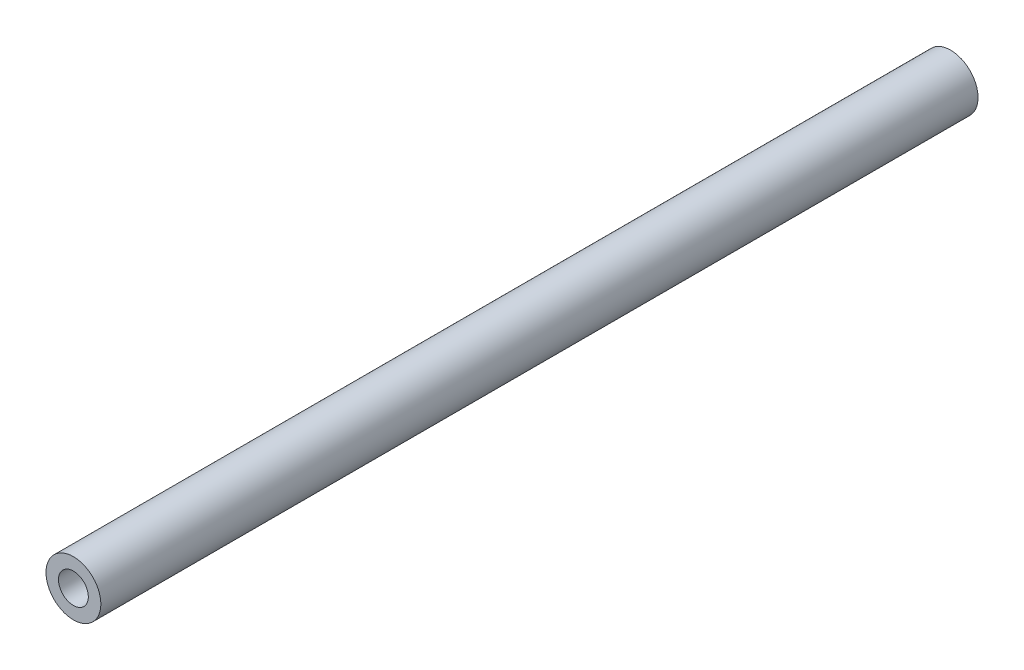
ISO-10303-21;
HEADER;
FILE_DESCRIPTION(('STEP AP214'),'2;1');
FILE_NAME('part.step','',(''),(''),'','','');
FILE_SCHEMA(('AUTOMOTIVE_DESIGN { 1 0 10303 214 1 1 1 1 }'));
ENDSEC;
DATA;
#1=APPLICATION_CONTEXT('core data for automotive mechanical design processes');
#2=APPLICATION_PROTOCOL_DEFINITION('international standard','automotive_design',2000,#1);
#3=PRODUCT_CONTEXT('',#1,'mechanical');
#4=PRODUCT('Part','Part','',(#3));
#5=PRODUCT_RELATED_PRODUCT_CATEGORY('part','',(#4));
#6=PRODUCT_DEFINITION_FORMATION('','',#4);
#7=PRODUCT_DEFINITION_CONTEXT('part definition',#1,'design');
#8=PRODUCT_DEFINITION('design','',#6,#7);
#9=PRODUCT_DEFINITION_SHAPE('','',#8);
#10=(LENGTH_UNIT() NAMED_UNIT(*) SI_UNIT(.MILLI.,.METRE.));
#11=(NAMED_UNIT(*) PLANE_ANGLE_UNIT() SI_UNIT($,.RADIAN.));
#12=(NAMED_UNIT(*) SI_UNIT($,.STERADIAN.) SOLID_ANGLE_UNIT());
#13=UNCERTAINTY_MEASURE_WITH_UNIT(LENGTH_MEASURE(1.E-05),#10,'distance_accuracy_value','');
#14=(GEOMETRIC_REPRESENTATION_CONTEXT(3) GLOBAL_UNCERTAINTY_ASSIGNED_CONTEXT((#13)) GLOBAL_UNIT_ASSIGNED_CONTEXT((#10,
#11,#12)) REPRESENTATION_CONTEXT('',''));
#15=CARTESIAN_POINT('',(0.,0.,0.));
#16=DIRECTION('',(0.,0.,1.));
#17=DIRECTION('',(1.,0.,0.));
#18=AXIS2_PLACEMENT_3D('',#15,#16,#17);
#19=CARTESIAN_POINT('',(1.11022302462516E-13,-1.94289029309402E-13,101.599999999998));
#20=DIRECTION('',(0.,0.,0.999999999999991));
#21=DIRECTION('',(1.00000000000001,0.,0.));
#22=AXIS2_PLACEMENT_3D('',#19,#20,#21);
#23=PLANE('',#22);
#24=CARTESIAN_POINT('',(1.11022302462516E-13,-1.94289029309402E-13,101.599999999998));
#25=DIRECTION('',(0.,0.,0.999999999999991));
#26=DIRECTION('',(1.00000000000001,0.,0.));
#27=AXIS2_PLACEMENT_3D('',#24,#25,#26);
#28=CIRCLE('',#27,1.72719999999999);
#29=CARTESIAN_POINT('',(1.72720000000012,-1.94193150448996E-13,101.599999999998));
#30=VERTEX_POINT('',#29);
#31=EDGE_CURVE('E63',#30,#30,#28,.T.);
#32=ORIENTED_EDGE('',*,*,#31,.F.);
#33=EDGE_LOOP('',(#32));
#34=FACE_BOUND('',#33,.T.);
#35=CARTESIAN_POINT('',(1.11022302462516E-13,-1.94289029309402E-13,101.599999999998));
#36=DIRECTION('',(0.,0.,0.999999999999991));
#37=DIRECTION('',(1.00000000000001,0.,0.));
#38=AXIS2_PLACEMENT_3D('',#35,#36,#37);
#39=CIRCLE('',#38,3.175);
#40=CARTESIAN_POINT('',(-3.17499999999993,-1.94465277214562E-13,101.599999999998));
#41=VERTEX_POINT('',#40);
#42=EDGE_CURVE('E10',#41,#41,#39,.T.);
#43=ORIENTED_EDGE('',*,*,#42,.T.);
#44=EDGE_LOOP('',(#43));
#45=FACE_BOUND('',#44,.T.);
#46=ADVANCED_FACE('F34',(#34,#45),#23,.T.);
#47=CARTESIAN_POINT('',(0.,0.,-4.44089209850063E-13));
#48=DIRECTION('',(0.,0.,0.999999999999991));
#49=DIRECTION('',(1.00000000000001,0.,0.));
#50=AXIS2_PLACEMENT_3D('',#47,#48,#49);
#51=PLANE('',#50);
#52=CARTESIAN_POINT('',(0.,0.,-4.44089209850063E-13));
#53=DIRECTION('',(0.,0.,-0.999999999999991));
#54=DIRECTION('',(-1.00000000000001,0.,0.));
#55=AXIS2_PLACEMENT_3D('',#52,#53,#54);
#56=CIRCLE('',#55,1.7272);
#57=CARTESIAN_POINT('',(-1.72719999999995,0.,-4.44089209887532E-13));
#58=VERTEX_POINT('',#57);
#59=EDGE_CURVE('E50',#58,#58,#56,.T.);
#60=ORIENTED_EDGE('',*,*,#59,.F.);
#61=EDGE_LOOP('',(#60));
#62=FACE_BOUND('',#61,.T.);
#63=CARTESIAN_POINT('',(0.,0.,-4.44089209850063E-13));
#64=DIRECTION('',(0.,0.,0.999999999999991));
#65=DIRECTION('',(1.00000000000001,0.,0.));
#66=AXIS2_PLACEMENT_3D('',#63,#64,#65);
#67=CIRCLE('',#66,3.175);
#68=CARTESIAN_POINT('',(-3.17499999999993,-1.94465277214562E-13,-4.44089209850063E-13));
#69=VERTEX_POINT('',#68);
#70=EDGE_CURVE('E42',#69,#69,#67,.T.);
#71=ORIENTED_EDGE('',*,*,#70,.F.);
#72=EDGE_LOOP('',(#71));
#73=FACE_BOUND('',#72,.T.);
#74=ADVANCED_FACE('F81',(#62,#73),#51,.F.);
#75=CARTESIAN_POINT('',(1.11022302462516E-13,-1.94289029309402E-13,101.599999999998));
#76=DIRECTION('',(0.,0.,-0.999999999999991));
#77=DIRECTION('',(-1.00000000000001,0.,0.));
#78=AXIS2_PLACEMENT_3D('',#75,#76,#77);
#79=CYLINDRICAL_SURFACE('',#78,3.175);
#80=CARTESIAN_POINT('',(-3.17499999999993,-1.94465277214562E-13,101.599999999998));
#81=CARTESIAN_POINT('',(-3.17499999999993,-1.94465277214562E-13,100.541666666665));
#82=CARTESIAN_POINT('',(-3.17499999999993,-1.94465277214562E-13,99.4833333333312));
#83=CARTESIAN_POINT('',(-3.17499999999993,-1.94465277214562E-13,97.3666666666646));
#84=CARTESIAN_POINT('',(-3.17499999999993,-1.94465277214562E-13,96.3083333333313));
#85=CARTESIAN_POINT('',(-3.17499999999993,-1.94465277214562E-13,94.1916666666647));
#86=CARTESIAN_POINT('',(-3.17499999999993,-1.94465277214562E-13,93.1333333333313));
#87=CARTESIAN_POINT('',(-3.17499999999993,-1.94465277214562E-13,91.0166666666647));
#88=CARTESIAN_POINT('',(-3.17499999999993,-1.94465277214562E-13,89.9583333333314));
#89=CARTESIAN_POINT('',(-3.17499999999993,-1.94465277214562E-13,87.8416666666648));
#90=CARTESIAN_POINT('',(-3.17499999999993,-1.94465277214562E-13,86.7833333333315));
#91=CARTESIAN_POINT('',(-3.17499999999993,-1.94465277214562E-13,84.6666666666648));
#92=CARTESIAN_POINT('',(-3.17499999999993,-1.94465277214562E-13,83.6083333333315));
#93=CARTESIAN_POINT('',(-3.17499999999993,-1.94465277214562E-13,81.4916666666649));
#94=CARTESIAN_POINT('',(-3.17499999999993,-1.94465277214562E-13,80.4333333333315));
#95=CARTESIAN_POINT('',(-3.17499999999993,-1.94465277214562E-13,78.3166666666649));
#96=CARTESIAN_POINT('',(-3.17499999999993,-1.94465277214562E-13,77.2583333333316));
#97=CARTESIAN_POINT('',(-3.17499999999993,-1.94465277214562E-13,75.141666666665));
#98=CARTESIAN_POINT('',(-3.17499999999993,-1.94465277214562E-13,74.0833333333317));
#99=CARTESIAN_POINT('',(-3.17499999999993,-1.94465277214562E-13,71.966666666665));
#100=CARTESIAN_POINT('',(-3.17499999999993,-1.94465277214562E-13,70.9083333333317));
#101=CARTESIAN_POINT('',(-3.17499999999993,-1.94465277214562E-13,68.7916666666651));
#102=CARTESIAN_POINT('',(-3.17499999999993,-1.94465277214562E-13,67.7333333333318));
#103=CARTESIAN_POINT('',(-3.17499999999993,-1.94465277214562E-13,65.6166666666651));
#104=CARTESIAN_POINT('',(-3.17499999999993,-1.94465277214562E-13,64.5583333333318));
#105=CARTESIAN_POINT('',(-3.17499999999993,-1.94465277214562E-13,62.4416666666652));
#106=CARTESIAN_POINT('',(-3.17499999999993,-1.94465277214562E-13,61.3833333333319));
#107=CARTESIAN_POINT('',(-3.17499999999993,-1.94465277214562E-13,59.2666666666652));
#108=CARTESIAN_POINT('',(-3.17499999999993,-1.94465277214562E-13,58.2083333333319));
#109=CARTESIAN_POINT('',(-3.17499999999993,-1.94465277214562E-13,56.0916666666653));
#110=CARTESIAN_POINT('',(-3.17499999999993,-1.94465277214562E-13,55.033333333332));
#111=CARTESIAN_POINT('',(-3.17499999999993,-1.94465277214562E-13,52.9166666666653));
#112=CARTESIAN_POINT('',(-3.17499999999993,-1.94465277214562E-13,51.858333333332));
#113=CARTESIAN_POINT('',(-3.17499999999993,-1.94465277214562E-13,49.7416666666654));
#114=CARTESIAN_POINT('',(-3.17499999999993,-1.94465277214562E-13,48.6833333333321));
#115=CARTESIAN_POINT('',(-3.17499999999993,-1.94465277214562E-13,46.5666666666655));
#116=CARTESIAN_POINT('',(-3.17499999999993,-1.94465277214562E-13,45.5083333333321));
#117=CARTESIAN_POINT('',(-3.17499999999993,-1.94465277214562E-13,43.3916666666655));
#118=CARTESIAN_POINT('',(-3.17499999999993,-1.94465277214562E-13,42.3333333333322));
#119=CARTESIAN_POINT('',(-3.17499999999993,-1.94465277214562E-13,40.2166666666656));
#120=CARTESIAN_POINT('',(-3.17499999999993,-1.94465277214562E-13,39.1583333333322));
#121=CARTESIAN_POINT('',(-3.17499999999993,-1.94465277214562E-13,37.0416666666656));
#122=CARTESIAN_POINT('',(-3.17499999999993,-1.94465277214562E-13,35.9833333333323));
#123=CARTESIAN_POINT('',(-3.17499999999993,-1.94465277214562E-13,33.8666666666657));
#124=CARTESIAN_POINT('',(-3.17499999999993,-1.94465277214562E-13,32.8083333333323));
#125=CARTESIAN_POINT('',(-3.17499999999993,-1.94465277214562E-13,30.6916666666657));
#126=CARTESIAN_POINT('',(-3.17499999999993,-1.94465277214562E-13,29.6333333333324));
#127=CARTESIAN_POINT('',(-3.17499999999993,-1.94465277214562E-13,27.5166666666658));
#128=CARTESIAN_POINT('',(-3.17499999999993,-1.94465277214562E-13,26.4583333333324));
#129=CARTESIAN_POINT('',(-3.17499999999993,-1.94465277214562E-13,24.3416666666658));
#130=CARTESIAN_POINT('',(-3.17499999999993,-1.94465277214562E-13,23.2833333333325));
#131=CARTESIAN_POINT('',(-3.17499999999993,-1.94465277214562E-13,21.1666666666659));
#132=CARTESIAN_POINT('',(-3.17499999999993,-1.94465277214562E-13,20.1083333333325));
#133=CARTESIAN_POINT('',(-3.17499999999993,-1.94465277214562E-13,17.9916666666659));
#134=CARTESIAN_POINT('',(-3.17499999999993,-1.94465277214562E-13,16.9333333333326));
#135=CARTESIAN_POINT('',(-3.17499999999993,-1.94465277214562E-13,14.816666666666));
#136=CARTESIAN_POINT('',(-3.17499999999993,-1.94465277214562E-13,13.7583333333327));
#137=CARTESIAN_POINT('',(-3.17499999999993,-1.94465277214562E-13,11.641666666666));
#138=CARTESIAN_POINT('',(-3.17499999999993,-1.94465277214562E-13,10.5833333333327));
#139=CARTESIAN_POINT('',(-3.17499999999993,-1.94465277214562E-13,8.46666666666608));
#140=CARTESIAN_POINT('',(-3.17499999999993,-1.94465277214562E-13,7.40833333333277));
#141=CARTESIAN_POINT('',(-3.17499999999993,-1.94465277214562E-13,5.29166666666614));
#142=CARTESIAN_POINT('',(-3.17499999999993,-1.94465277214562E-13,4.23333333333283));
#143=CARTESIAN_POINT('',(-3.17499999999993,-1.94465277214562E-13,2.11666666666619));
#144=CARTESIAN_POINT('',(-3.17499999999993,-1.94465277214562E-13,1.05833333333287));
#145=CARTESIAN_POINT('',(-3.17499999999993,-1.94465277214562E-13,-4.44089209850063E-13));
#146=B_SPLINE_CURVE_WITH_KNOTS('',3,(#80,#81,#82,#83,#84,#85,#86,#87,#88,#89,#90,#91,#92,#93,
#94,#95,#96,#97,#98,#99,#100,#101,#102,#103,#104,#105,#106,#107,#108,#109,#110,#111,#112,#113,
#114,#115,#116,#117,#118,#119,#120,#121,#122,#123,#124,#125,#126,#127,#128,#129,#130,#131,#132,
#133,#134,#135,#136,#137,#138,#139,#140,#141,#142,#143,#144,#145),.UNSPECIFIED.,.F.,.F.,(4,2,2,
2,2,2,2,2,2,2,2,2,2,2,2,2,2,2,2,2,2,2,2,2,2,2,2,2,2,2,2,2,4),(0.,3.17499999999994,
6.34999999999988,9.52499999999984,12.6999999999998,15.8749999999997,19.0499999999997,
22.2249999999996,25.3999999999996,28.5749999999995,31.7499999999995,34.9249999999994,
38.0999999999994,41.2749999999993,44.4499999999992,47.6249999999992,50.7999999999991,
53.9749999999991,57.149999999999,60.324999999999,63.4999999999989,66.6749999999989,
69.8499999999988,73.0249999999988,76.1999999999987,79.3749999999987,82.5499999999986,
85.7249999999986,88.8999999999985,92.0749999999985,95.2499999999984,98.4249999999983,
101.599999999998),.UNSPECIFIED.);
#147=EDGE_CURVE('BSEAM36',#41,#69,#146,.T.);
#148=ORIENTED_EDGE('',*,*,#42,.F.);
#149=ORIENTED_EDGE('',*,*,#70,.T.);
#150=ORIENTED_EDGE('',*,*,#147,.T.);
#151=ORIENTED_EDGE('',*,*,#147,.F.);
#152=EDGE_LOOP('',(#148,#150,#149,#151));
#153=FACE_BOUND('',#152,.T.);
#154=ADVANCED_FACE('F36',(#153),#79,.T.);
#155=CARTESIAN_POINT('',(1.11022302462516E-13,-1.94289029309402E-13,101.599999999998));
#156=DIRECTION('',(0.,0.,-0.999999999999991));
#157=DIRECTION('',(-1.00000000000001,0.,0.));
#158=AXIS2_PLACEMENT_3D('',#155,#156,#157);
#159=CYLINDRICAL_SURFACE('',#158,1.524);
#160=CARTESIAN_POINT('',(0.,-1.45716771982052E-13,89.031905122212));
#161=DIRECTION('',(0.,0.,0.999999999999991));
#162=DIRECTION('',(1.00000000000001,0.,0.));
#163=AXIS2_PLACEMENT_3D('',#160,#161,#162);
#164=CIRCLE('',#163,1.524);
#165=CARTESIAN_POINT('',(-1.52399999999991,-1.94373628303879E-13,89.031905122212));
#166=VERTEX_POINT('',#165);
#167=EDGE_CURVE('E38',#166,#166,#164,.F.);
#168=CARTESIAN_POINT('',(0.,0.,12.5680948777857));
#169=DIRECTION('',(0.,0.,-0.999999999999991));
#170=DIRECTION('',(-1.00000000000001,0.,0.));
#171=AXIS2_PLACEMENT_3D('',#168,#169,#170);
#172=CIRCLE('',#171,1.524);
#173=CARTESIAN_POINT('',(-1.52399999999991,-1.94373628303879E-13,12.5680948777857));
#174=VERTEX_POINT('',#173);
#175=EDGE_CURVE('E47',#174,#174,#172,.F.);
#176=CARTESIAN_POINT('',(-1.52399999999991,-1.94373628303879E-13,89.031905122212));
#177=CARTESIAN_POINT('',(-1.52399999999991,-1.94373628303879E-13,88.2354070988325));
#178=CARTESIAN_POINT('',(-1.52399999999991,-1.94373628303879E-13,87.4389090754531));
#179=CARTESIAN_POINT('',(-1.52399999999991,-1.94373628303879E-13,85.8459130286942));
#180=CARTESIAN_POINT('',(-1.52399999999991,-1.94373628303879E-13,85.0494150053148));
#181=CARTESIAN_POINT('',(-1.52399999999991,-1.94373628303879E-13,83.4564189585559));
#182=CARTESIAN_POINT('',(-1.52399999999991,-1.94373628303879E-13,82.6599209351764));
#183=CARTESIAN_POINT('',(-1.52399999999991,-1.94373628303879E-13,81.0669248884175));
#184=CARTESIAN_POINT('',(-1.52399999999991,-1.94373628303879E-13,80.2704268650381));
#185=CARTESIAN_POINT('',(-1.52399999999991,-1.94373628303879E-13,78.6774308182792));
#186=CARTESIAN_POINT('',(-1.52399999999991,-1.94373628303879E-13,77.8809327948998));
#187=CARTESIAN_POINT('',(-1.52399999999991,-1.94373628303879E-13,76.2879367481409));
#188=CARTESIAN_POINT('',(-1.52399999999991,-1.94373628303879E-13,75.4914387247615));
#189=CARTESIAN_POINT('',(-1.52399999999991,-1.94373628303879E-13,73.8984426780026));
#190=CARTESIAN_POINT('',(-1.52399999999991,-1.94373628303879E-13,73.1019446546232));
#191=CARTESIAN_POINT('',(-1.52399999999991,-1.94373628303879E-13,71.5089486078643));
#192=CARTESIAN_POINT('',(-1.52399999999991,-1.94373628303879E-13,70.7124505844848));
#193=CARTESIAN_POINT('',(-1.52399999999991,-1.94373628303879E-13,69.1194545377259));
#194=CARTESIAN_POINT('',(-1.52399999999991,-1.94373628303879E-13,68.3229565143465));
#195=CARTESIAN_POINT('',(-1.52399999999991,-1.94373628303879E-13,66.7299604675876));
#196=CARTESIAN_POINT('',(-1.52399999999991,-1.94373628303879E-13,65.9334624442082));
#197=CARTESIAN_POINT('',(-1.52399999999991,-1.94373628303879E-13,64.3404663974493));
#198=CARTESIAN_POINT('',(-1.52399999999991,-1.94373628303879E-13,63.5439683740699));
#199=CARTESIAN_POINT('',(-1.52399999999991,-1.94373628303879E-13,61.950972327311));
#200=CARTESIAN_POINT('',(-1.52399999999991,-1.94373628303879E-13,61.1544743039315));
#201=CARTESIAN_POINT('',(-1.52399999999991,-1.94373628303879E-13,59.5614782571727));
#202=CARTESIAN_POINT('',(-1.52399999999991,-1.94373628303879E-13,58.7649802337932));
#203=CARTESIAN_POINT('',(-1.52399999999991,-1.94373628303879E-13,57.1719841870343));
#204=CARTESIAN_POINT('',(-1.52399999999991,-1.94373628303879E-13,56.3754861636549));
#205=CARTESIAN_POINT('',(-1.52399999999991,-1.94373628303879E-13,54.782490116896));
#206=CARTESIAN_POINT('',(-1.52399999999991,-1.94373628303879E-13,53.9859920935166));
#207=CARTESIAN_POINT('',(-1.52399999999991,-1.94373628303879E-13,52.3929960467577));
#208=CARTESIAN_POINT('',(-1.52399999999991,-1.94373628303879E-13,51.5964980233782));
#209=CARTESIAN_POINT('',(-1.52399999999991,-1.94373628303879E-13,50.0035019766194));
#210=CARTESIAN_POINT('',(-1.52399999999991,-1.94373628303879E-13,49.2070039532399));
#211=CARTESIAN_POINT('',(-1.52399999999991,-1.94373628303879E-13,47.614007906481));
#212=CARTESIAN_POINT('',(-1.52399999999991,-1.94373628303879E-13,46.8175098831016));
#213=CARTESIAN_POINT('',(-1.52399999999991,-1.94373628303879E-13,45.2245138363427));
#214=CARTESIAN_POINT('',(-1.52399999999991,-1.94373628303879E-13,44.4280158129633));
#215=CARTESIAN_POINT('',(-1.52399999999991,-1.94373628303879E-13,42.8350197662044));
#216=CARTESIAN_POINT('',(-1.52399999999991,-1.94373628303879E-13,42.038521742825));
#217=CARTESIAN_POINT('',(-1.52399999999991,-1.94373628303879E-13,40.4455256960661));
#218=CARTESIAN_POINT('',(-1.52399999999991,-1.94373628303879E-13,39.6490276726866));
#219=CARTESIAN_POINT('',(-1.52399999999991,-1.94373628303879E-13,38.0560316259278));
#220=CARTESIAN_POINT('',(-1.52399999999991,-1.94373628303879E-13,37.2595336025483));
#221=CARTESIAN_POINT('',(-1.52399999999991,-1.94373628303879E-13,35.6665375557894));
#222=CARTESIAN_POINT('',(-1.52399999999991,-1.94373628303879E-13,34.87003953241));
#223=CARTESIAN_POINT('',(-1.52399999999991,-1.94373628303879E-13,33.2770434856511));
#224=CARTESIAN_POINT('',(-1.52399999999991,-1.94373628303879E-13,32.4805454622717));
#225=CARTESIAN_POINT('',(-1.52399999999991,-1.94373628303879E-13,30.8875494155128));
#226=CARTESIAN_POINT('',(-1.52399999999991,-1.94373628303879E-13,30.0910513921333));
#227=CARTESIAN_POINT('',(-1.52399999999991,-1.94373628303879E-13,28.4980553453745));
#228=CARTESIAN_POINT('',(-1.52399999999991,-1.94373628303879E-13,27.701557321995));
#229=CARTESIAN_POINT('',(-1.52399999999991,-1.94373628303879E-13,26.1085612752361));
#230=CARTESIAN_POINT('',(-1.52399999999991,-1.94373628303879E-13,25.3120632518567));
#231=CARTESIAN_POINT('',(-1.52399999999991,-1.94373628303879E-13,23.7190672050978));
#232=CARTESIAN_POINT('',(-1.52399999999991,-1.94373628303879E-13,22.9225691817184));
#233=CARTESIAN_POINT('',(-1.52399999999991,-1.94373628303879E-13,21.3295731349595));
#234=CARTESIAN_POINT('',(-1.52399999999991,-1.94373628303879E-13,20.5330751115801));
#235=CARTESIAN_POINT('',(-1.52399999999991,-1.94373628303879E-13,18.9400790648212));
#236=CARTESIAN_POINT('',(-1.52399999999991,-1.94373628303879E-13,18.1435810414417));
#237=CARTESIAN_POINT('',(-1.52399999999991,-1.94373628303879E-13,16.5505849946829));
#238=CARTESIAN_POINT('',(-1.52399999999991,-1.94373628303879E-13,15.7540869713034));
#239=CARTESIAN_POINT('',(-1.52399999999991,-1.94373628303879E-13,14.1610909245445));
#240=CARTESIAN_POINT('',(-1.52399999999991,-1.94373628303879E-13,13.3645929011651));
#241=CARTESIAN_POINT('',(-1.52399999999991,-1.94373628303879E-13,12.5680948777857));
#242=B_SPLINE_CURVE_WITH_KNOTS('',3,(#176,#177,#178,#179,#180,#181,#182,#183,#184,#185,#186,
#187,#188,#189,#190,#191,#192,#193,#194,#195,#196,#197,#198,#199,#200,#201,#202,#203,#204,#205,
#206,#207,#208,#209,#210,#211,#212,#213,#214,#215,#216,#217,#218,#219,#220,#221,#222,#223,#224,
#225,#226,#227,#228,#229,#230,#231,#232,#233,#234,#235,#236,#237,#238,#239,#240,#241),
.UNSPECIFIED.,.F.,.F.,(4,2,2,2,2,2,2,2,2,2,2,2,2,2,2,2,2,2,2,2,2,2,2,2,2,2,2,2,2,2,2,2,4),(0.,
2.38949407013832,4.77898814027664,7.16848221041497,9.55797628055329,11.9474703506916,
14.3369644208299,16.7264584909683,19.1159525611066,21.5054466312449,23.8949407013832,
26.2844347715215,28.6739288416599,31.0634229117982,33.4529169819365,35.8424110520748,
38.2319051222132,40.6213991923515,43.0108932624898,45.4003873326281,47.7898814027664,
50.1793754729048,52.5688695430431,54.9583636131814,57.3478576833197,59.7373517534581,
62.1268458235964,64.5163398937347,66.905833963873,69.2953280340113,71.6848221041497,
74.074316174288,76.4638102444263),.UNSPECIFIED.);
#243=EDGE_CURVE('BSEAM88',#166,#174,#242,.T.);
#244=ORIENTED_EDGE('',*,*,#167,.F.);
#245=ORIENTED_EDGE('',*,*,#175,.F.);
#246=ORIENTED_EDGE('',*,*,#243,.T.);
#247=ORIENTED_EDGE('',*,*,#243,.F.);
#248=EDGE_LOOP('',(#244,#246,#245,#247));
#249=FACE_BOUND('',#248,.T.);
#250=ADVANCED_FACE('F88',(#249),#159,.F.);
#251=CARTESIAN_POINT('',(0.,0.,-4.44089209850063E-13));
#252=DIRECTION('',(0.,0.,-0.999999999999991));
#253=DIRECTION('',(-1.00000000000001,0.,0.));
#254=AXIS2_PLACEMENT_3D('',#251,#252,#253);
#255=CYLINDRICAL_SURFACE('',#254,1.7272);
#256=CARTESIAN_POINT('',(0.,0.,12.4459999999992));
#257=DIRECTION('',(0.,0.,-0.999999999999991));
#258=DIRECTION('',(-1.00000000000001,0.,0.));
#259=AXIS2_PLACEMENT_3D('',#256,#257,#258);
#260=CIRCLE('',#259,1.7272);
#261=CARTESIAN_POINT('',(-1.72719999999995,0.,12.4459999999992));
#262=VERTEX_POINT('',#261);
#263=EDGE_CURVE('E56',#262,#262,#260,.T.);
#264=CARTESIAN_POINT('',(-1.72719999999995,0.,12.4459999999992));
#265=CARTESIAN_POINT('',(-1.72719999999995,0.,12.3163541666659));
#266=CARTESIAN_POINT('',(-1.72719999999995,0.,12.1867083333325));
#267=CARTESIAN_POINT('',(-1.72719999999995,0.,11.9274166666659));
#268=CARTESIAN_POINT('',(-1.72719999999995,0.,11.7977708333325));
#269=CARTESIAN_POINT('',(-1.72719999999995,0.,11.5384791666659));
#270=CARTESIAN_POINT('',(-1.72719999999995,0.,11.4088333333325));
#271=CARTESIAN_POINT('',(-1.72719999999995,0.,11.1495416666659));
#272=CARTESIAN_POINT('',(-1.72719999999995,0.,11.0198958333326));
#273=CARTESIAN_POINT('',(-1.72719999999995,0.,10.7606041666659));
#274=CARTESIAN_POINT('',(-1.72719999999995,0.,10.6309583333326));
#275=CARTESIAN_POINT('',(-1.72719999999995,0.,10.3716666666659));
#276=CARTESIAN_POINT('',(-1.72719999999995,0.,10.2420208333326));
#277=CARTESIAN_POINT('',(-1.72719999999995,0.,9.98272916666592));
#278=CARTESIAN_POINT('',(-1.72719999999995,0.,9.85308333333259));
#279=CARTESIAN_POINT('',(-1.72719999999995,0.,9.59379166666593));
#280=CARTESIAN_POINT('',(-1.72719999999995,0.,9.4641458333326));
#281=CARTESIAN_POINT('',(-1.72719999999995,0.,9.20485416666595));
#282=CARTESIAN_POINT('',(-1.72719999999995,0.,9.07520833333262));
#283=CARTESIAN_POINT('',(-1.72719999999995,0.,8.81591666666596));
#284=CARTESIAN_POINT('',(-1.72719999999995,0.,8.68627083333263));
#285=CARTESIAN_POINT('',(-1.72719999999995,0.,8.42697916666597));
#286=CARTESIAN_POINT('',(-1.72719999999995,0.,8.29733333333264));
#287=CARTESIAN_POINT('',(-1.72719999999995,0.,8.03804166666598));
#288=CARTESIAN_POINT('',(-1.72719999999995,0.,7.90839583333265));
#289=CARTESIAN_POINT('',(-1.72719999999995,0.,7.64910416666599));
#290=CARTESIAN_POINT('',(-1.72719999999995,0.,7.51945833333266));
#291=CARTESIAN_POINT('',(-1.72719999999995,0.,7.260166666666));
#292=CARTESIAN_POINT('',(-1.72719999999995,0.,7.13052083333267));
#293=CARTESIAN_POINT('',(-1.72719999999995,0.,6.87122916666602));
#294=CARTESIAN_POINT('',(-1.72719999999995,0.,6.74158333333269));
#295=CARTESIAN_POINT('',(-1.72719999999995,0.,6.48229166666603));
#296=CARTESIAN_POINT('',(-1.72719999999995,0.,6.3526458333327));
#297=CARTESIAN_POINT('',(-1.72719999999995,0.,6.09335416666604));
#298=CARTESIAN_POINT('',(-1.72719999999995,0.,5.96370833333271));
#299=CARTESIAN_POINT('',(-1.72719999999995,0.,5.70441666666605));
#300=CARTESIAN_POINT('',(-1.72719999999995,0.,5.57477083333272));
#301=CARTESIAN_POINT('',(-1.72719999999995,0.,5.31547916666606));
#302=CARTESIAN_POINT('',(-1.72719999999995,0.,5.18583333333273));
#303=CARTESIAN_POINT('',(-1.72719999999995,0.,4.92654166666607));
#304=CARTESIAN_POINT('',(-1.72719999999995,0.,4.79689583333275));
#305=CARTESIAN_POINT('',(-1.72719999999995,0.,4.53760416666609));
#306=CARTESIAN_POINT('',(-1.72719999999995,0.,4.40795833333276));
#307=CARTESIAN_POINT('',(-1.72719999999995,0.,4.1486666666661));
#308=CARTESIAN_POINT('',(-1.72719999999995,0.,4.01902083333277));
#309=CARTESIAN_POINT('',(-1.72719999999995,0.,3.75972916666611));
#310=CARTESIAN_POINT('',(-1.72719999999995,0.,3.63008333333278));
#311=CARTESIAN_POINT('',(-1.72719999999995,0.,3.37079166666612));
#312=CARTESIAN_POINT('',(-1.72719999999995,0.,3.24114583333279));
#313=CARTESIAN_POINT('',(-1.72719999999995,0.,2.98185416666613));
#314=CARTESIAN_POINT('',(-1.72719999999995,0.,2.8522083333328));
#315=CARTESIAN_POINT('',(-1.72719999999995,0.,2.59291666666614));
#316=CARTESIAN_POINT('',(-1.72719999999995,0.,2.46327083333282));
#317=CARTESIAN_POINT('',(-1.72719999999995,0.,2.20397916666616));
#318=CARTESIAN_POINT('',(-1.72719999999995,0.,2.07433333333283));
#319=CARTESIAN_POINT('',(-1.72719999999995,0.,1.81504166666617));
#320=CARTESIAN_POINT('',(-1.72719999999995,0.,1.68539583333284));
#321=CARTESIAN_POINT('',(-1.72719999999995,0.,1.42610416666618));
#322=CARTESIAN_POINT('',(-1.72719999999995,0.,1.29645833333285));
#323=CARTESIAN_POINT('',(-1.72719999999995,0.,1.03716666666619));
#324=CARTESIAN_POINT('',(-1.72719999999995,0.,0.907520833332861));
#325=CARTESIAN_POINT('',(-1.72719999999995,0.,0.648229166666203));
#326=CARTESIAN_POINT('',(-1.72719999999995,0.,0.518583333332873));
#327=CARTESIAN_POINT('',(-1.72719999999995,0.,0.259291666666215));
#328=CARTESIAN_POINT('',(-1.72719999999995,0.,0.129645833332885));
#329=CARTESIAN_POINT('',(-1.72719999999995,0.,-4.44089209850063E-13));
#330=B_SPLINE_CURVE_WITH_KNOTS('',3,(#264,#265,#266,#267,#268,#269,#270,#271,#272,#273,#274,
#275,#276,#277,#278,#279,#280,#281,#282,#283,#284,#285,#286,#287,#288,#289,#290,#291,#292,#293,
#294,#295,#296,#297,#298,#299,#300,#301,#302,#303,#304,#305,#306,#307,#308,#309,#310,#311,#312,
#313,#314,#315,#316,#317,#318,#319,#320,#321,#322,#323,#324,#325,#326,#327,#328,#329),
.UNSPECIFIED.,.F.,.F.,(4,2,2,2,2,2,2,2,2,2,2,2,2,2,2,2,2,2,2,2,2,2,2,2,2,2,2,2,2,2,2,2,4),(0.,
0.388937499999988,0.777874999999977,1.16681249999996,1.55574999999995,1.94468749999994,
2.33362499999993,2.72256249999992,3.11149999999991,3.50043749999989,3.88937499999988,
4.27831249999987,4.66724999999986,5.05618749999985,5.44512499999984,5.83406249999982,
6.22299999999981,6.6119374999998,7.00087499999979,7.38981249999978,7.77874999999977,
8.16768749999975,8.55662499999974,8.94556249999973,9.33449999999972,9.72343749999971,
10.1123749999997,10.5013124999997,10.8902499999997,11.2791874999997,11.6681249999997,
12.0570624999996,12.4459999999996),.UNSPECIFIED.);
#331=EDGE_CURVE('BSEAM91',#262,#58,#330,.T.);
#332=ORIENTED_EDGE('',*,*,#263,.F.);
#333=ORIENTED_EDGE('',*,*,#59,.T.);
#334=ORIENTED_EDGE('',*,*,#331,.T.);
#335=ORIENTED_EDGE('',*,*,#331,.F.);
#336=EDGE_LOOP('',(#332,#334,#333,#335));
#337=FACE_BOUND('',#336,.T.);
#338=ADVANCED_FACE('F91',(#337),#255,.F.);
#339=CARTESIAN_POINT('',(0.,0.,12.4459999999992));
#340=DIRECTION('',(0.,0.,-0.999999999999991));
#341=DIRECTION('',(-1.00000000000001,0.,0.));
#342=AXIS2_PLACEMENT_3D('',#339,#340,#341);
#343=CONICAL_SURFACE('',#342,1.7272,1.02974425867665);
#344=CARTESIAN_POINT('',(-1.52399999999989,0.,12.5680948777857));
#345=CARTESIAN_POINT('',(-1.52611666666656,0.,12.566823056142));
#346=CARTESIAN_POINT('',(-1.52823333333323,0.,12.5655512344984));
#347=CARTESIAN_POINT('',(-1.53246666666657,0.,12.5630075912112));
#348=CARTESIAN_POINT('',(-1.53458333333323,0.,12.5617357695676));
#349=CARTESIAN_POINT('',(-1.53881666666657,0.,12.5591921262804));
#350=CARTESIAN_POINT('',(-1.54093333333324,0.,12.5579203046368));
#351=CARTESIAN_POINT('',(-1.54516666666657,0.,12.5553766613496));
#352=CARTESIAN_POINT('',(-1.54728333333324,0.,12.554104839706));
#353=CARTESIAN_POINT('',(-1.55151666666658,0.,12.5515611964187));
#354=CARTESIAN_POINT('',(-1.55363333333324,0.,12.5502893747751));
#355=CARTESIAN_POINT('',(-1.55786666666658,0.,12.5477457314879));
#356=CARTESIAN_POINT('',(-1.55998333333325,0.,12.5464739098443));
#357=CARTESIAN_POINT('',(-1.56421666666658,0.,12.5439302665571));
#358=CARTESIAN_POINT('',(-1.56633333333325,0.,12.5426584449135));
#359=CARTESIAN_POINT('',(-1.57056666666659,0.,12.5401148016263));
#360=CARTESIAN_POINT('',(-1.57268333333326,0.,12.5388429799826));
#361=CARTESIAN_POINT('',(-1.57691666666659,0.,12.5362993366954));
#362=CARTESIAN_POINT('',(-1.57903333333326,0.,12.5350275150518));
#363=CARTESIAN_POINT('',(-1.5832666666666,0.,12.5324838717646));
#364=CARTESIAN_POINT('',(-1.58538333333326,0.,12.531212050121));
#365=CARTESIAN_POINT('',(-1.5896166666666,0.,12.5286684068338));
#366=CARTESIAN_POINT('',(-1.59173333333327,0.,12.5273965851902));
#367=CARTESIAN_POINT('',(-1.5959666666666,0.,12.5248529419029));
#368=CARTESIAN_POINT('',(-1.59808333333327,0.,12.5235811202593));
#369=CARTESIAN_POINT('',(-1.60231666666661,0.,12.5210374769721));
#370=CARTESIAN_POINT('',(-1.60443333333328,0.,12.5197656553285));
#371=CARTESIAN_POINT('',(-1.60866666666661,0.,12.5172220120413));
#372=CARTESIAN_POINT('',(-1.61078333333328,0.,12.5159501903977));
#373=CARTESIAN_POINT('',(-1.61501666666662,0.,12.5134065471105));
#374=CARTESIAN_POINT('',(-1.61713333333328,0.,12.5121347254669));
#375=CARTESIAN_POINT('',(-1.62136666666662,0.,12.5095910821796));
#376=CARTESIAN_POINT('',(-1.62348333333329,0.,12.508319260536));
#377=CARTESIAN_POINT('',(-1.62771666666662,0.,12.5057756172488));
#378=CARTESIAN_POINT('',(-1.62983333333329,0.,12.5045037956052));
#379=CARTESIAN_POINT('',(-1.63406666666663,0.,12.501960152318));
#380=CARTESIAN_POINT('',(-1.63618333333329,0.,12.5006883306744));
#381=CARTESIAN_POINT('',(-1.64041666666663,0.,12.4981446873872));
#382=CARTESIAN_POINT('',(-1.6425333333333,0.,12.4968728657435));
#383=CARTESIAN_POINT('',(-1.64676666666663,0.,12.4943292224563));
#384=CARTESIAN_POINT('',(-1.6488833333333,0.,12.4930574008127));
#385=CARTESIAN_POINT('',(-1.65311666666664,0.,12.4905137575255));
#386=CARTESIAN_POINT('',(-1.65523333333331,0.,12.4892419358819));
#387=CARTESIAN_POINT('',(-1.65946666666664,0.,12.4866982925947));
#388=CARTESIAN_POINT('',(-1.66158333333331,0.,12.4854264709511));
#389=CARTESIAN_POINT('',(-1.66581666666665,0.,12.4828828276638));
#390=CARTESIAN_POINT('',(-1.66793333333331,0.,12.4816110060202));
#391=CARTESIAN_POINT('',(-1.67216666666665,0.,12.479067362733));
#392=CARTESIAN_POINT('',(-1.67428333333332,0.,12.4777955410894));
#393=CARTESIAN_POINT('',(-1.67851666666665,0.,12.4752518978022));
#394=CARTESIAN_POINT('',(-1.68063333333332,0.,12.4739800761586));
#395=CARTESIAN_POINT('',(-1.68486666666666,0.,12.4714364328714));
#396=CARTESIAN_POINT('',(-1.68698333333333,0.,12.4701646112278));
#397=CARTESIAN_POINT('',(-1.69121666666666,0.,12.4676209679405));
#398=CARTESIAN_POINT('',(-1.69333333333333,0.,12.4663491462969));
#399=CARTESIAN_POINT('',(-1.69756666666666,0.,12.4638055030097));
#400=CARTESIAN_POINT('',(-1.69968333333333,0.,12.4625336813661));
#401=CARTESIAN_POINT('',(-1.70391666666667,0.,12.4599900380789));
#402=CARTESIAN_POINT('',(-1.70603333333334,0.,12.4587182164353));
#403=CARTESIAN_POINT('',(-1.71026666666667,0.,12.4561745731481));
#404=CARTESIAN_POINT('',(-1.71238333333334,0.,12.4549027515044));
#405=CARTESIAN_POINT('',(-1.71661666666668,0.,12.4523591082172));
#406=CARTESIAN_POINT('',(-1.71873333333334,0.,12.4510872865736));
#407=CARTESIAN_POINT('',(-1.72296666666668,0.,12.4485436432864));
#408=CARTESIAN_POINT('',(-1.72508333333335,0.,12.4472718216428));
#409=CARTESIAN_POINT('',(-1.72720000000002,0.,12.4459999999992));
#410=B_SPLINE_CURVE_WITH_KNOTS('',3,(#344,#345,#346,#347,#348,#349,#350,#351,#352,#353,#354,
#355,#356,#357,#358,#359,#360,#361,#362,#363,#364,#365,#366,#367,#368,#369,#370,#371,#372,#373,
#374,#375,#376,#377,#378,#379,#380,#381,#382,#383,#384,#385,#386,#387,#388,#389,#390,#391,#392,
#393,#394,#395,#396,#397,#398,#399,#400,#401,#402,#403,#404,#405,#406,#407,#408,#409),
.UNSPECIFIED.,.F.,.F.,(4,2,2,2,2,2,2,2,2,2,2,2,2,2,2,2,2,2,2,2,2,2,2,2,2,2,2,2,2,2,2,2,4),(0.,
0.00740812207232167,0.0148162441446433,0.0222243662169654,0.0296324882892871,0.0370406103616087,
0.0444487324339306,0.0518568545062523,0.0592649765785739,0.066673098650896,0.0740812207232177,
0.0814893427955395,0.0888974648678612,0.0963055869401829,0.103713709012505,0.111121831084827,
0.118529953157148,0.12593807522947,0.133346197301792,0.140754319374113,0.148162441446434,
0.155570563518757,0.162978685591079,0.1703868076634,0.177794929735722,0.185203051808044,
0.192611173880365,0.200019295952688,0.207427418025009,0.21483554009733,0.222243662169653,
0.229651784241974,0.237059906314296),.UNSPECIFIED.);
#411=EDGE_CURVE('BSEAM76',#174,#262,#410,.T.);
#412=ORIENTED_EDGE('',*,*,#175,.T.);
#413=ORIENTED_EDGE('',*,*,#263,.T.);
#414=ORIENTED_EDGE('',*,*,#411,.T.);
#415=ORIENTED_EDGE('',*,*,#411,.F.);
#416=EDGE_LOOP('',(#412,#414,#413,#415));
#417=FACE_BOUND('',#416,.T.);
#418=ADVANCED_FACE('F76',(#417),#343,.F.);
#419=CARTESIAN_POINT('',(1.11022302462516E-13,-1.94289029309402E-13,101.599999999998));
#420=DIRECTION('',(0.,0.,0.999999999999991));
#421=DIRECTION('',(1.00000000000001,0.,0.));
#422=AXIS2_PLACEMENT_3D('',#419,#420,#421);
#423=CYLINDRICAL_SURFACE('',#422,1.72719999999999);
#424=CARTESIAN_POINT('',(0.,-1.45716771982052E-13,89.1539999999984));
#425=DIRECTION('',(0.,0.,0.999999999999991));
#426=DIRECTION('',(1.00000000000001,0.,0.));
#427=AXIS2_PLACEMENT_3D('',#424,#425,#426);
#428=CIRCLE('',#427,1.7272);
#429=CARTESIAN_POINT('',(1.72720000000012,-1.94193150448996E-13,89.1539999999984));
#430=VERTEX_POINT('',#429);
#431=EDGE_CURVE('E67',#430,#430,#428,.T.);
#432=CARTESIAN_POINT('',(1.72720000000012,-1.94193150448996E-13,89.1539999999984));
#433=CARTESIAN_POINT('',(1.72720000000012,-1.94193150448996E-13,89.2836458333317));
#434=CARTESIAN_POINT('',(1.72720000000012,-1.94193150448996E-13,89.4132916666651));
#435=CARTESIAN_POINT('',(1.72720000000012,-1.94193150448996E-13,89.6725833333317));
#436=CARTESIAN_POINT('',(1.72720000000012,-1.94193150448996E-13,89.8022291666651));
#437=CARTESIAN_POINT('',(1.72720000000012,-1.94193150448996E-13,90.0615208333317));
#438=CARTESIAN_POINT('',(1.72720000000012,-1.94193150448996E-13,90.191166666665));
#439=CARTESIAN_POINT('',(1.72720000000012,-1.94193150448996E-13,90.4504583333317));
#440=CARTESIAN_POINT('',(1.72720000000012,-1.94193150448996E-13,90.580104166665));
#441=CARTESIAN_POINT('',(1.72720000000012,-1.94193150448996E-13,90.8393958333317));
#442=CARTESIAN_POINT('',(1.72720000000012,-1.94193150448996E-13,90.969041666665));
#443=CARTESIAN_POINT('',(1.72720000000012,-1.94193150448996E-13,91.2283333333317));
#444=CARTESIAN_POINT('',(1.72720000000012,-1.94193150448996E-13,91.357979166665));
#445=CARTESIAN_POINT('',(1.72720000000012,-1.94193150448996E-13,91.6172708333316));
#446=CARTESIAN_POINT('',(1.72720000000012,-1.94193150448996E-13,91.746916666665));
#447=CARTESIAN_POINT('',(1.72720000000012,-1.94193150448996E-13,92.0062083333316));
#448=CARTESIAN_POINT('',(1.72720000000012,-1.94193150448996E-13,92.135854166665));
#449=CARTESIAN_POINT('',(1.72720000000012,-1.94193150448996E-13,92.3951458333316));
#450=CARTESIAN_POINT('',(1.72720000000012,-1.94193150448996E-13,92.5247916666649));
#451=CARTESIAN_POINT('',(1.72720000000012,-1.94193150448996E-13,92.7840833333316));
#452=CARTESIAN_POINT('',(1.72720000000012,-1.94193150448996E-13,92.9137291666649));
#453=CARTESIAN_POINT('',(1.72720000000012,-1.94193150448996E-13,93.1730208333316));
#454=CARTESIAN_POINT('',(1.72720000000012,-1.94193150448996E-13,93.3026666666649));
#455=CARTESIAN_POINT('',(1.72720000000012,-1.94193150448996E-13,93.5619583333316));
#456=CARTESIAN_POINT('',(1.72720000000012,-1.94193150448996E-13,93.6916041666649));
#457=CARTESIAN_POINT('',(1.72720000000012,-1.94193150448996E-13,93.9508958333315));
#458=CARTESIAN_POINT('',(1.72720000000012,-1.94193150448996E-13,94.0805416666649));
#459=CARTESIAN_POINT('',(1.72720000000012,-1.94193150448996E-13,94.3398333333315));
#460=CARTESIAN_POINT('',(1.72720000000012,-1.94193150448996E-13,94.4694791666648));
#461=CARTESIAN_POINT('',(1.72720000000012,-1.94193150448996E-13,94.7287708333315));
#462=CARTESIAN_POINT('',(1.72720000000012,-1.94193150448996E-13,94.8584166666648));
#463=CARTESIAN_POINT('',(1.72720000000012,-1.94193150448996E-13,95.1177083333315));
#464=CARTESIAN_POINT('',(1.72720000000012,-1.94193150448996E-13,95.2473541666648));
#465=CARTESIAN_POINT('',(1.72720000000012,-1.94193150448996E-13,95.5066458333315));
#466=CARTESIAN_POINT('',(1.72720000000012,-1.94193150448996E-13,95.6362916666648));
#467=CARTESIAN_POINT('',(1.72720000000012,-1.94193150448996E-13,95.8955833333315));
#468=CARTESIAN_POINT('',(1.72720000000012,-1.94193150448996E-13,96.0252291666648));
#469=CARTESIAN_POINT('',(1.72720000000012,-1.94193150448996E-13,96.2845208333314));
#470=CARTESIAN_POINT('',(1.72720000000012,-1.94193150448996E-13,96.4141666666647));
#471=CARTESIAN_POINT('',(1.72720000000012,-1.94193150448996E-13,96.6734583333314));
#472=CARTESIAN_POINT('',(1.72720000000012,-1.94193150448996E-13,96.8031041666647));
#473=CARTESIAN_POINT('',(1.72720000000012,-1.94193150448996E-13,97.0623958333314));
#474=CARTESIAN_POINT('',(1.72720000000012,-1.94193150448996E-13,97.1920416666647));
#475=CARTESIAN_POINT('',(1.72720000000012,-1.94193150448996E-13,97.4513333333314));
#476=CARTESIAN_POINT('',(1.72720000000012,-1.94193150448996E-13,97.5809791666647));
#477=CARTESIAN_POINT('',(1.72720000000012,-1.94193150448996E-13,97.8402708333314));
#478=CARTESIAN_POINT('',(1.72720000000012,-1.94193150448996E-13,97.9699166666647));
#479=CARTESIAN_POINT('',(1.72720000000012,-1.94193150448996E-13,98.2292083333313));
#480=CARTESIAN_POINT('',(1.72720000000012,-1.94193150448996E-13,98.3588541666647));
#481=CARTESIAN_POINT('',(1.72720000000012,-1.94193150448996E-13,98.6181458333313));
#482=CARTESIAN_POINT('',(1.72720000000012,-1.94193150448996E-13,98.7477916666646));
#483=CARTESIAN_POINT('',(1.72720000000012,-1.94193150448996E-13,99.0070833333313));
#484=CARTESIAN_POINT('',(1.72720000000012,-1.94193150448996E-13,99.1367291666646));
#485=CARTESIAN_POINT('',(1.72720000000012,-1.94193150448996E-13,99.3960208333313));
#486=CARTESIAN_POINT('',(1.72720000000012,-1.94193150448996E-13,99.5256666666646));
#487=CARTESIAN_POINT('',(1.72720000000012,-1.94193150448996E-13,99.7849583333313));
#488=CARTESIAN_POINT('',(1.72720000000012,-1.94193150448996E-13,99.9146041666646));
#489=CARTESIAN_POINT('',(1.72720000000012,-1.94193150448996E-13,100.173895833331));
#490=CARTESIAN_POINT('',(1.72720000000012,-1.94193150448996E-13,100.303541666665));
#491=CARTESIAN_POINT('',(1.72720000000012,-1.94193150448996E-13,100.562833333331));
#492=CARTESIAN_POINT('',(1.72720000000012,-1.94193150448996E-13,100.692479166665));
#493=CARTESIAN_POINT('',(1.72720000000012,-1.94193150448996E-13,100.951770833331));
#494=CARTESIAN_POINT('',(1.72720000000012,-1.94193150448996E-13,101.081416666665));
#495=CARTESIAN_POINT('',(1.72720000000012,-1.94193150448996E-13,101.340708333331));
#496=CARTESIAN_POINT('',(1.72720000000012,-1.94193150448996E-13,101.470354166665));
#497=CARTESIAN_POINT('',(1.72720000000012,-1.94193150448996E-13,101.599999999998));
#498=B_SPLINE_CURVE_WITH_KNOTS('',3,(#432,#433,#434,#435,#436,#437,#438,#439,#440,#441,#442,
#443,#444,#445,#446,#447,#448,#449,#450,#451,#452,#453,#454,#455,#456,#457,#458,#459,#460,#461,
#462,#463,#464,#465,#466,#467,#468,#469,#470,#471,#472,#473,#474,#475,#476,#477,#478,#479,#480,
#481,#482,#483,#484,#485,#486,#487,#488,#489,#490,#491,#492,#493,#494,#495,#496,#497),
.UNSPECIFIED.,.F.,.F.,(4,2,2,2,2,2,2,2,2,2,2,2,2,2,2,2,2,2,2,2,2,2,2,2,2,2,2,2,2,2,2,2,4),(0.,
0.388937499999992,0.77787499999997,1.16681249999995,1.55574999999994,1.94468749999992,
2.33362499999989,2.72256249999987,3.11149999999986,3.50043749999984,3.88937499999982,
4.27831249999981,4.66724999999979,5.05618749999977,5.44512499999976,5.83406249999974,
6.22299999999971,6.61193749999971,7.00087499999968,7.38981249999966,7.77874999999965,
8.16768749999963,8.55662499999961,8.9455624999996,9.33449999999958,9.72343749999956,
10.1123749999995,10.5013124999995,10.8902499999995,11.2791874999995,11.6681249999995,
12.0570624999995,12.4459999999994),.UNSPECIFIED.);
#499=EDGE_CURVE('BSEAM73',#430,#30,#498,.T.);
#500=ORIENTED_EDGE('',*,*,#431,.F.);
#501=ORIENTED_EDGE('',*,*,#31,.T.);
#502=ORIENTED_EDGE('',*,*,#499,.T.);
#503=ORIENTED_EDGE('',*,*,#499,.F.);
#504=EDGE_LOOP('',(#500,#502,#501,#503));
#505=FACE_BOUND('',#504,.T.);
#506=ADVANCED_FACE('F73',(#505),#423,.F.);
#507=CARTESIAN_POINT('',(0.,-1.45716771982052E-13,89.1539999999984));
#508=DIRECTION('',(0.,0.,0.999999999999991));
#509=DIRECTION('',(1.00000000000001,0.,0.));
#510=AXIS2_PLACEMENT_3D('',#507,#508,#509);
#511=CONICAL_SURFACE('',#510,1.7272,1.02974425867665);
#512=ORIENTED_EDGE('',*,*,#167,.T.);
#513=EDGE_LOOP('',(#512));
#514=FACE_BOUND('',#513,.T.);
#515=ORIENTED_EDGE('',*,*,#431,.T.);
#516=EDGE_LOOP('',(#515));
#517=FACE_BOUND('',#516,.T.);
#518=ADVANCED_FACE('F71',(#514,#517),#511,.F.);
#519=CLOSED_SHELL('',(#46,#74,#154,#250,#338,#418,#506,#518));
#520=MANIFOLD_SOLID_BREP('B2',#519);
#521=ADVANCED_BREP_SHAPE_REPRESENTATION('',(#18,#520),#14);
#522=SHAPE_DEFINITION_REPRESENTATION(#9,#521);
ENDSEC;
END-ISO-10303-21;
